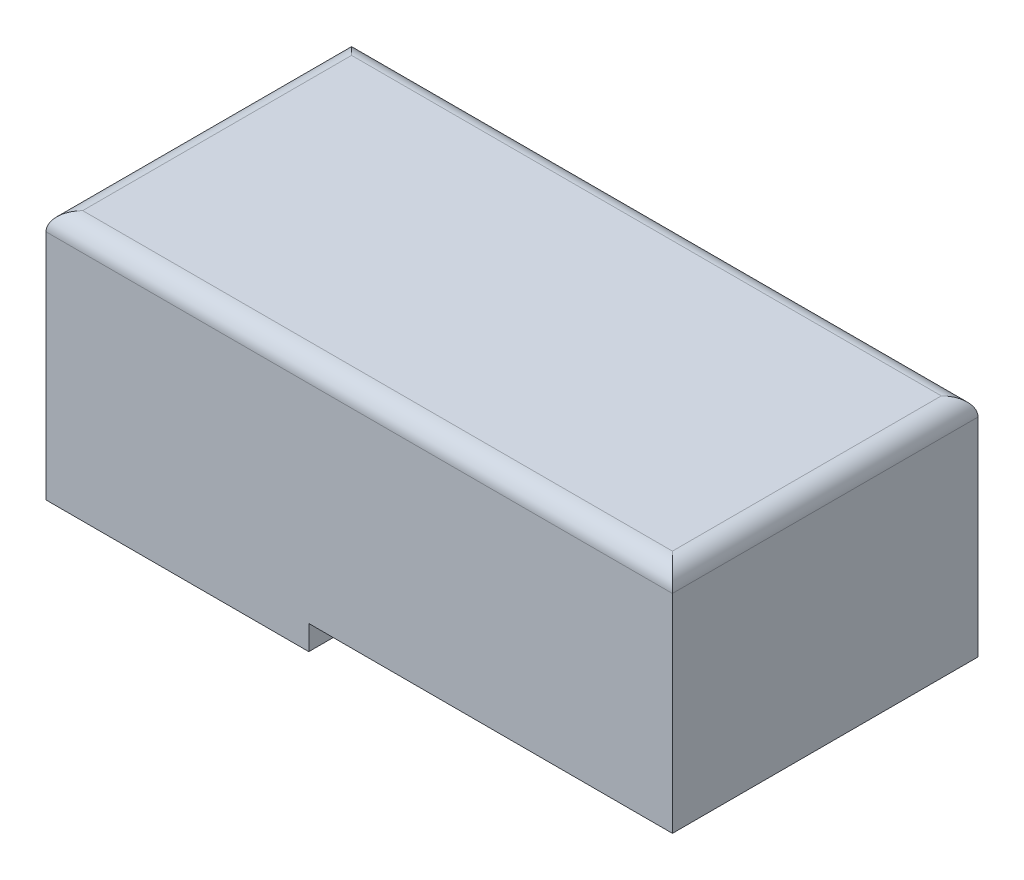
ISO-10303-21;
HEADER;
FILE_DESCRIPTION(('STEP AP214'),'2;1');
FILE_NAME('part.step','',(''),(''),'','','');
FILE_SCHEMA(('AUTOMOTIVE_DESIGN { 1 0 10303 214 1 1 1 1 }'));
ENDSEC;
DATA;
#1=APPLICATION_CONTEXT('core data for automotive mechanical design processes');
#2=APPLICATION_PROTOCOL_DEFINITION('international standard','automotive_design',2000,#1);
#3=PRODUCT_CONTEXT('',#1,'mechanical');
#4=PRODUCT('Part','Part','',(#3));
#5=PRODUCT_RELATED_PRODUCT_CATEGORY('part','',(#4));
#6=PRODUCT_DEFINITION_FORMATION('','',#4);
#7=PRODUCT_DEFINITION_CONTEXT('part definition',#1,'design');
#8=PRODUCT_DEFINITION('design','',#6,#7);
#9=PRODUCT_DEFINITION_SHAPE('','',#8);
#10=(LENGTH_UNIT() NAMED_UNIT(*) SI_UNIT(.MILLI.,.METRE.));
#11=(NAMED_UNIT(*) PLANE_ANGLE_UNIT() SI_UNIT($,.RADIAN.));
#12=(NAMED_UNIT(*) SI_UNIT($,.STERADIAN.) SOLID_ANGLE_UNIT());
#13=UNCERTAINTY_MEASURE_WITH_UNIT(LENGTH_MEASURE(1.E-05),#10,'distance_accuracy_value','');
#14=(GEOMETRIC_REPRESENTATION_CONTEXT(3) GLOBAL_UNCERTAINTY_ASSIGNED_CONTEXT((#13)) GLOBAL_UNIT_ASSIGNED_CONTEXT((#10,
#11,#12)) REPRESENTATION_CONTEXT('',''));
#15=CARTESIAN_POINT('',(0.,0.,0.));
#16=DIRECTION('',(0.,0.,1.));
#17=DIRECTION('',(1.,0.,0.));
#18=AXIS2_PLACEMENT_3D('',#15,#16,#17);
#19=CARTESIAN_POINT('',(-49.0331698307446,-4.,25.));
#20=DIRECTION('',(0.,1.,0.));
#21=DIRECTION('',(-1.,0.,0.));
#22=AXIS2_PLACEMENT_3D('',#19,#20,#21);
#23=PLANE('',#22);
#24=CARTESIAN_POINT('',(-71.0331698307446,-4.00000000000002,0.));
#25=DIRECTION('',(0.,1.,0.));
#26=DIRECTION('',(0.,0.,1.));
#27=AXIS2_PLACEMENT_3D('',#24,#25,#26);
#28=CIRCLE('',#27,7.5);
#29=CARTESIAN_POINT('',(-71.0331698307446,-4.00000000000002,7.5));
#30=VERTEX_POINT('',#29);
#31=EDGE_CURVE('E164',#30,#30,#28,.T.);
#32=ORIENTED_EDGE('',*,*,#31,.T.);
#33=EDGE_LOOP('',(#32));
#34=FACE_BOUND('',#33,.T.);
#35=DIRECTION('',(1.,0.,0.));
#36=VECTOR('',#35,1.);
#37=CARTESIAN_POINT('',(-49.0331698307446,-4.,-25.));
#38=LINE('',#37,#36);
#39=CARTESIAN_POINT('',(-92.0331698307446,-4.00000000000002,-25.));
#40=VERTEX_POINT('',#39);
#41=CARTESIAN_POINT('',(-49.0331698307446,-4.,-25.));
#42=VERTEX_POINT('',#41);
#43=EDGE_CURVE('E167',#40,#42,#38,.T.);
#44=ORIENTED_EDGE('',*,*,#43,.T.);
#45=DIRECTION('',(0.,0.,-1.));
#46=VECTOR('',#45,1.);
#47=CARTESIAN_POINT('',(-49.0331698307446,-4.,25.));
#48=LINE('',#47,#46);
#49=CARTESIAN_POINT('',(-49.0331698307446,-4.,25.));
#50=VERTEX_POINT('',#49);
#51=EDGE_CURVE('E193',#50,#42,#48,.T.);
#52=ORIENTED_EDGE('',*,*,#51,.F.);
#53=DIRECTION('',(1.,0.,0.));
#54=VECTOR('',#53,1.);
#55=CARTESIAN_POINT('',(-49.0331698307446,-4.,25.));
#56=LINE('',#55,#54);
#57=CARTESIAN_POINT('',(-92.0331698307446,-4.00000000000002,25.));
#58=VERTEX_POINT('',#57);
#59=EDGE_CURVE('E168',#58,#50,#56,.T.);
#60=ORIENTED_EDGE('',*,*,#59,.F.);
#61=DIRECTION('',(0.,0.,-1.));
#62=VECTOR('',#61,1.);
#63=CARTESIAN_POINT('',(-92.0331698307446,-4.00000000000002,25.));
#64=LINE('',#63,#62);
#65=EDGE_CURVE('E179',#58,#40,#64,.T.);
#66=ORIENTED_EDGE('',*,*,#65,.T.);
#67=EDGE_LOOP('',(#44,#52,#60,#66));
#68=FACE_BOUND('',#67,.T.);
#69=ADVANCED_FACE('F34',(#34,#68),#23,.F.);
#70=CARTESIAN_POINT('',(-49.0331698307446,0.,25.));
#71=DIRECTION('',(-1.,0.,0.));
#72=DIRECTION('',(0.,0.,1.));
#73=AXIS2_PLACEMENT_3D('',#70,#71,#72);
#74=PLANE('',#73);
#75=DIRECTION('',(0.,1.,0.));
#76=VECTOR('',#75,1.);
#77=CARTESIAN_POINT('',(-49.0331698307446,0.,-25.));
#78=LINE('',#77,#76);
#79=CARTESIAN_POINT('',(-49.0331698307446,0.,-25.));
#80=VERTEX_POINT('',#79);
#81=EDGE_CURVE('E182',#42,#80,#78,.T.);
#82=ORIENTED_EDGE('',*,*,#81,.T.);
#83=DIRECTION('',(0.,0.,-1.));
#84=VECTOR('',#83,1.);
#85=CARTESIAN_POINT('',(-49.0331698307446,0.,25.));
#86=LINE('',#85,#84);
#87=CARTESIAN_POINT('',(-49.0331698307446,0.,25.));
#88=VERTEX_POINT('',#87);
#89=EDGE_CURVE('E190',#88,#80,#86,.T.);
#90=ORIENTED_EDGE('',*,*,#89,.F.);
#91=DIRECTION('',(0.,1.,0.));
#92=VECTOR('',#91,1.);
#93=CARTESIAN_POINT('',(-49.0331698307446,0.,25.));
#94=LINE('',#93,#92);
#95=EDGE_CURVE('E171',#50,#88,#94,.T.);
#96=ORIENTED_EDGE('',*,*,#95,.F.);
#97=ORIENTED_EDGE('',*,*,#51,.T.);
#98=EDGE_LOOP('',(#82,#90,#96,#97));
#99=FACE_BOUND('',#98,.T.);
#100=ADVANCED_FACE('F250',(#99),#74,.F.);
#101=CARTESIAN_POINT('',(13.4668301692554,0.,25.));
#102=DIRECTION('',(0.,1.,0.));
#103=DIRECTION('',(-1.,0.,0.));
#104=AXIS2_PLACEMENT_3D('',#101,#102,#103);
#105=PLANE('',#104);
#106=DIRECTION('',(-1.,0.,0.));
#107=VECTOR('',#106,1.);
#108=CARTESIAN_POINT('',(13.4668301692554,0.,-5.));
#109=LINE('',#108,#107);
#110=CARTESIAN_POINT('',(-7.53316983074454,0.,-5.));
#111=VERTEX_POINT('',#110);
#112=CARTESIAN_POINT('',(-17.5331698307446,0.,-5.));
#113=VERTEX_POINT('',#112);
#114=EDGE_CURVE('E159',#111,#113,#109,.T.);
#115=ORIENTED_EDGE('',*,*,#114,.T.);
#116=CARTESIAN_POINT('',(-17.5331698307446,0.,0.));
#117=DIRECTION('',(0.,1.,0.));
#118=DIRECTION('',(-1.,0.,0.));
#119=AXIS2_PLACEMENT_3D('',#116,#117,#118);
#120=CIRCLE('',#119,5.);
#121=CARTESIAN_POINT('',(-17.5331698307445,0.,5.));
#122=VERTEX_POINT('',#121);
#123=EDGE_CURVE('E162',#113,#122,#120,.T.);
#124=ORIENTED_EDGE('',*,*,#123,.T.);
#125=DIRECTION('',(1.,0.,0.));
#126=VECTOR('',#125,1.);
#127=CARTESIAN_POINT('',(13.4668301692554,0.,5.));
#128=LINE('',#127,#126);
#129=CARTESIAN_POINT('',(-7.53316983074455,0.,5.));
#130=VERTEX_POINT('',#129);
#131=EDGE_CURVE('E146',#122,#130,#128,.T.);
#132=ORIENTED_EDGE('',*,*,#131,.T.);
#133=CARTESIAN_POINT('',(-7.53316983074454,0.,0.));
#134=DIRECTION('',(0.,1.,0.));
#135=DIRECTION('',(-1.,0.,0.));
#136=AXIS2_PLACEMENT_3D('',#133,#134,#135);
#137=CIRCLE('',#136,5.);
#138=EDGE_CURVE('E156',#130,#111,#137,.T.);
#139=ORIENTED_EDGE('',*,*,#138,.T.);
#140=EDGE_LOOP('',(#115,#124,#132,#139));
#141=FACE_BOUND('',#140,.T.);
#142=DIRECTION('',(1.,0.,0.));
#143=VECTOR('',#142,1.);
#144=CARTESIAN_POINT('',(13.4668301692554,0.,-25.));
#145=LINE('',#144,#143);
#146=CARTESIAN_POINT('',(10.4668301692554,0.,-25.));
#147=VERTEX_POINT('',#146);
#148=EDGE_CURVE('E184',#80,#147,#145,.T.);
#149=ORIENTED_EDGE('',*,*,#148,.T.);
#150=DIRECTION('',(0.,0.,1.));
#151=VECTOR('',#150,1.);
#152=CARTESIAN_POINT('',(10.4668301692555,0.,25.));
#153=LINE('',#152,#151);
#154=CARTESIAN_POINT('',(10.4668301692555,0.,25.));
#155=VERTEX_POINT('',#154);
#156=EDGE_CURVE('E142',#147,#155,#153,.T.);
#157=ORIENTED_EDGE('',*,*,#156,.T.);
#158=DIRECTION('',(1.,0.,0.));
#159=VECTOR('',#158,1.);
#160=CARTESIAN_POINT('',(13.4668301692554,0.,25.));
#161=LINE('',#160,#159);
#162=EDGE_CURVE('E174',#88,#155,#161,.T.);
#163=ORIENTED_EDGE('',*,*,#162,.F.);
#164=ORIENTED_EDGE('',*,*,#89,.T.);
#165=EDGE_LOOP('',(#149,#157,#163,#164));
#166=FACE_BOUND('',#165,.T.);
#167=ADVANCED_FACE('F246',(#141,#166),#105,.F.);
#168=CARTESIAN_POINT('',(-92.0331698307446,-4.00000000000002,25.));
#169=DIRECTION('',(1.,0.,0.));
#170=DIRECTION('',(0.,0.,-1.));
#171=AXIS2_PLACEMENT_3D('',#168,#169,#170);
#172=PLANE('',#171);
#173=DIRECTION('',(0.,-1.,0.));
#174=VECTOR('',#173,1.);
#175=CARTESIAN_POINT('',(-92.0331698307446,-4.00000000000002,25.));
#176=LINE('',#175,#174);
#177=CARTESIAN_POINT('',(-92.0331698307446,34.,25.));
#178=VERTEX_POINT('',#177);
#179=EDGE_CURVE('E177',#178,#58,#176,.T.);
#180=ORIENTED_EDGE('',*,*,#179,.F.);
#181=DIRECTION('',(0.,0.,1.));
#182=VECTOR('',#181,1.);
#183=CARTESIAN_POINT('',(-92.0331698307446,34.,25.));
#184=LINE('',#183,#182);
#185=CARTESIAN_POINT('',(-92.0331698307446,34.,-25.));
#186=VERTEX_POINT('',#185);
#187=EDGE_CURVE('E11',#178,#186,#184,.F.);
#188=ORIENTED_EDGE('',*,*,#187,.T.);
#189=DIRECTION('',(0.,-1.,0.));
#190=VECTOR('',#189,1.);
#191=CARTESIAN_POINT('',(-92.0331698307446,-4.00000000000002,-25.));
#192=LINE('',#191,#190);
#193=EDGE_CURVE('E172',#186,#40,#192,.T.);
#194=ORIENTED_EDGE('',*,*,#193,.T.);
#195=ORIENTED_EDGE('',*,*,#65,.F.);
#196=EDGE_LOOP('',(#180,#188,#194,#195));
#197=FACE_BOUND('',#196,.T.);
#198=ADVANCED_FACE('F249',(#197),#172,.F.);
#199=CARTESIAN_POINT('',(0.,0.,25.));
#200=DIRECTION('',(0.,0.,-1.));
#201=DIRECTION('',(-1.,0.,0.));
#202=AXIS2_PLACEMENT_3D('',#199,#200,#201);
#203=PLANE('',#202);
#204=DIRECTION('',(0.,1.,0.));
#205=VECTOR('',#204,1.);
#206=CARTESIAN_POINT('',(10.4668301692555,-4.00000000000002,25.));
#207=LINE('',#206,#205);
#208=CARTESIAN_POINT('',(10.4668301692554,34.,25.));
#209=VERTEX_POINT('',#208);
#210=EDGE_CURVE('E228',#155,#209,#207,.T.);
#211=ORIENTED_EDGE('',*,*,#210,.T.);
#212=DIRECTION('',(1.,0.,0.));
#213=VECTOR('',#212,1.);
#214=CARTESIAN_POINT('',(0.,34.,25.));
#215=LINE('',#214,#213);
#216=EDGE_CURVE('E207',#209,#178,#215,.F.);
#217=ORIENTED_EDGE('',*,*,#216,.T.);
#218=ORIENTED_EDGE('',*,*,#179,.T.);
#219=ORIENTED_EDGE('',*,*,#59,.T.);
#220=ORIENTED_EDGE('',*,*,#95,.T.);
#221=ORIENTED_EDGE('',*,*,#162,.T.);
#222=EDGE_LOOP('',(#211,#217,#218,#219,#220,#221));
#223=FACE_BOUND('',#222,.T.);
#224=ADVANCED_FACE('F269',(#223),#203,.F.);
#225=CARTESIAN_POINT('',(0.,0.,-25.));
#226=DIRECTION('',(0.,0.,-1.));
#227=DIRECTION('',(-1.,0.,0.));
#228=AXIS2_PLACEMENT_3D('',#225,#226,#227);
#229=PLANE('',#228);
#230=ORIENTED_EDGE('',*,*,#193,.F.);
#231=DIRECTION('',(-1.,0.,0.));
#232=VECTOR('',#231,1.);
#233=CARTESIAN_POINT('',(10.4668301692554,34.,-25.));
#234=LINE('',#233,#232);
#235=CARTESIAN_POINT('',(10.4668301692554,34.,-25.));
#236=VERTEX_POINT('',#235);
#237=EDGE_CURVE('E43',#186,#236,#234,.F.);
#238=ORIENTED_EDGE('',*,*,#237,.T.);
#239=DIRECTION('',(0.,1.,0.));
#240=VECTOR('',#239,1.);
#241=CARTESIAN_POINT('',(10.4668301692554,0.,-25.));
#242=LINE('',#241,#240);
#243=EDGE_CURVE('E196',#147,#236,#242,.T.);
#244=ORIENTED_EDGE('',*,*,#243,.F.);
#245=ORIENTED_EDGE('',*,*,#148,.F.);
#246=ORIENTED_EDGE('',*,*,#81,.F.);
#247=ORIENTED_EDGE('',*,*,#43,.F.);
#248=EDGE_LOOP('',(#230,#238,#244,#245,#246,#247));
#249=FACE_BOUND('',#248,.T.);
#250=ADVANCED_FACE('F255',(#249),#229,.T.);
#251=CARTESIAN_POINT('',(-71.0331698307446,-4.00000000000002,0.));
#252=DIRECTION('',(0.,1.,0.));
#253=DIRECTION('',(0.,0.,1.));
#254=AXIS2_PLACEMENT_3D('',#251,#252,#253);
#255=CYLINDRICAL_SURFACE('',#254,7.5);
#256=ORIENTED_EDGE('',*,*,#31,.F.);
#257=EDGE_LOOP('',(#256));
#258=FACE_BOUND('',#257,.T.);
#259=CARTESIAN_POINT('',(-71.0331698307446,8.,0.));
#260=DIRECTION('',(0.,-1.,0.));
#261=DIRECTION('',(1.,0.,0.));
#262=AXIS2_PLACEMENT_3D('',#259,#260,#261);
#263=CIRCLE('',#262,7.5);
#264=CARTESIAN_POINT('',(-63.5331698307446,8.,0.));
#265=VERTEX_POINT('',#264);
#266=EDGE_CURVE('E223',#265,#265,#263,.F.);
#267=ORIENTED_EDGE('',*,*,#266,.T.);
#268=EDGE_LOOP('',(#267));
#269=FACE_BOUND('',#268,.T.);
#270=ADVANCED_FACE('F314',(#258,#269),#255,.F.);
#271=CARTESIAN_POINT('',(-17.5331698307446,-4.00000000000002,0.));
#272=DIRECTION('',(0.,1.,0.));
#273=DIRECTION('',(0.,0.,1.));
#274=AXIS2_PLACEMENT_3D('',#271,#272,#273);
#275=CYLINDRICAL_SURFACE('',#274,5.);
#276=DIRECTION('',(0.,1.,0.));
#277=VECTOR('',#276,1.);
#278=CARTESIAN_POINT('',(-17.5331698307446,-4.00000000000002,-5.));
#279=LINE('',#278,#277);
#280=CARTESIAN_POINT('',(-17.5331698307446,8.00000000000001,-5.));
#281=VERTEX_POINT('',#280);
#282=EDGE_CURVE('E140',#113,#281,#279,.T.);
#283=ORIENTED_EDGE('',*,*,#282,.T.);
#284=CARTESIAN_POINT('',(-17.5331698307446,8.00000000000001,0.));
#285=DIRECTION('',(0.,1.,0.));
#286=DIRECTION('',(0.,0.,1.));
#287=AXIS2_PLACEMENT_3D('',#284,#285,#286);
#288=CIRCLE('',#287,5.);
#289=CARTESIAN_POINT('',(-17.5331698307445,8.00000000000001,5.));
#290=VERTEX_POINT('',#289);
#291=EDGE_CURVE('E126',#281,#290,#288,.T.);
#292=ORIENTED_EDGE('',*,*,#291,.T.);
#293=DIRECTION('',(0.,1.,0.));
#294=VECTOR('',#293,1.);
#295=CARTESIAN_POINT('',(-17.5331698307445,-4.00000000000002,5.));
#296=LINE('',#295,#294);
#297=EDGE_CURVE('E137',#122,#290,#296,.T.);
#298=ORIENTED_EDGE('',*,*,#297,.F.);
#299=ORIENTED_EDGE('',*,*,#123,.F.);
#300=EDGE_LOOP('',(#283,#292,#298,#299));
#301=FACE_BOUND('',#300,.T.);
#302=ADVANCED_FACE('F136',(#301),#275,.F.);
#303=CARTESIAN_POINT('',(-17.5331698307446,-4.00000000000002,-5.));
#304=DIRECTION('',(0.,0.,-1.));
#305=DIRECTION('',(-1.,0.,0.));
#306=AXIS2_PLACEMENT_3D('',#303,#304,#305);
#307=PLANE('',#306);
#308=DIRECTION('',(0.,1.,0.));
#309=VECTOR('',#308,1.);
#310=CARTESIAN_POINT('',(-7.53316983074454,-4.00000000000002,-5.));
#311=LINE('',#310,#309);
#312=CARTESIAN_POINT('',(-7.53316983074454,8.00000000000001,-5.));
#313=VERTEX_POINT('',#312);
#314=EDGE_CURVE('E150',#111,#313,#311,.T.);
#315=ORIENTED_EDGE('',*,*,#314,.T.);
#316=DIRECTION('',(-1.,0.,0.));
#317=VECTOR('',#316,1.);
#318=CARTESIAN_POINT('',(-17.5331698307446,8.00000000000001,-5.));
#319=LINE('',#318,#317);
#320=EDGE_CURVE('E148',#313,#281,#319,.T.);
#321=ORIENTED_EDGE('',*,*,#320,.T.);
#322=ORIENTED_EDGE('',*,*,#282,.F.);
#323=ORIENTED_EDGE('',*,*,#114,.F.);
#324=EDGE_LOOP('',(#315,#321,#322,#323));
#325=FACE_BOUND('',#324,.T.);
#326=ADVANCED_FACE('F241',(#325),#307,.F.);
#327=CARTESIAN_POINT('',(-7.53316983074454,-4.00000000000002,0.));
#328=DIRECTION('',(0.,1.,0.));
#329=DIRECTION('',(0.,0.,1.));
#330=AXIS2_PLACEMENT_3D('',#327,#328,#329);
#331=CYLINDRICAL_SURFACE('',#330,5.);
#332=DIRECTION('',(0.,1.,0.));
#333=VECTOR('',#332,1.);
#334=CARTESIAN_POINT('',(-7.53316983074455,-4.00000000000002,5.));
#335=LINE('',#334,#333);
#336=CARTESIAN_POINT('',(-7.53316983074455,8.00000000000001,5.));
#337=VERTEX_POINT('',#336);
#338=EDGE_CURVE('E147',#130,#337,#335,.T.);
#339=ORIENTED_EDGE('',*,*,#338,.T.);
#340=CARTESIAN_POINT('',(-7.53316983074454,8.00000000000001,0.));
#341=DIRECTION('',(0.,1.,0.));
#342=DIRECTION('',(0.,0.,1.));
#343=AXIS2_PLACEMENT_3D('',#340,#341,#342);
#344=CIRCLE('',#343,5.);
#345=EDGE_CURVE('E129',#337,#313,#344,.T.);
#346=ORIENTED_EDGE('',*,*,#345,.T.);
#347=ORIENTED_EDGE('',*,*,#314,.F.);
#348=ORIENTED_EDGE('',*,*,#138,.F.);
#349=EDGE_LOOP('',(#339,#346,#347,#348));
#350=FACE_BOUND('',#349,.T.);
#351=ADVANCED_FACE('F244',(#350),#331,.F.);
#352=CARTESIAN_POINT('',(-17.5331698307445,-4.00000000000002,5.));
#353=DIRECTION('',(0.,0.,1.));
#354=DIRECTION('',(1.,0.,0.));
#355=AXIS2_PLACEMENT_3D('',#352,#353,#354);
#356=PLANE('',#355);
#357=ORIENTED_EDGE('',*,*,#297,.T.);
#358=DIRECTION('',(1.,0.,0.));
#359=VECTOR('',#358,1.);
#360=CARTESIAN_POINT('',(-17.5331698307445,8.00000000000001,5.));
#361=LINE('',#360,#359);
#362=EDGE_CURVE('E123',#290,#337,#361,.T.);
#363=ORIENTED_EDGE('',*,*,#362,.T.);
#364=ORIENTED_EDGE('',*,*,#338,.F.);
#365=ORIENTED_EDGE('',*,*,#131,.F.);
#366=EDGE_LOOP('',(#357,#363,#364,#365));
#367=FACE_BOUND('',#366,.T.);
#368=ADVANCED_FACE('F144',(#367),#356,.F.);
#369=CARTESIAN_POINT('',(10.4668301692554,-4.00000000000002,-25.));
#370=DIRECTION('',(-1.,0.,0.));
#371=DIRECTION('',(0.,-1.,0.));
#372=AXIS2_PLACEMENT_3D('',#369,#370,#371);
#373=PLANE('',#372);
#374=ORIENTED_EDGE('',*,*,#243,.T.);
#375=DIRECTION('',(0.,0.,-1.));
#376=VECTOR('',#375,1.);
#377=CARTESIAN_POINT('',(10.4668301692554,34.,-25.));
#378=LINE('',#377,#376);
#379=EDGE_CURVE('E210',#236,#209,#378,.F.);
#380=ORIENTED_EDGE('',*,*,#379,.T.);
#381=ORIENTED_EDGE('',*,*,#210,.F.);
#382=ORIENTED_EDGE('',*,*,#156,.F.);
#383=EDGE_LOOP('',(#374,#380,#381,#382));
#384=FACE_BOUND('',#383,.T.);
#385=ADVANCED_FACE('F258',(#384),#373,.F.);
#386=CARTESIAN_POINT('',(0.,37.,0.));
#387=DIRECTION('',(0.,-1.,0.));
#388=DIRECTION('',(1.,0.,0.));
#389=AXIS2_PLACEMENT_3D('',#386,#387,#388);
#390=PLANE('',#389);
#391=DIRECTION('',(0.,0.,1.));
#392=VECTOR('',#391,1.);
#393=CARTESIAN_POINT('',(-89.0331698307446,37.,0.));
#394=LINE('',#393,#392);
#395=CARTESIAN_POINT('',(-89.0331698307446,37.,-22.));
#396=VERTEX_POINT('',#395);
#397=CARTESIAN_POINT('',(-89.0331698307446,37.,22.));
#398=VERTEX_POINT('',#397);
#399=EDGE_CURVE('E198',#396,#398,#394,.T.);
#400=ORIENTED_EDGE('',*,*,#399,.T.);
#401=DIRECTION('',(1.,0.,0.));
#402=VECTOR('',#401,1.);
#403=CARTESIAN_POINT('',(0.,37.,22.));
#404=LINE('',#403,#402);
#405=CARTESIAN_POINT('',(7.46683016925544,37.,22.));
#406=VERTEX_POINT('',#405);
#407=EDGE_CURVE('E204',#398,#406,#404,.T.);
#408=ORIENTED_EDGE('',*,*,#407,.T.);
#409=DIRECTION('',(0.,0.,-1.));
#410=VECTOR('',#409,1.);
#411=CARTESIAN_POINT('',(7.46683016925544,37.,0.));
#412=LINE('',#411,#410);
#413=CARTESIAN_POINT('',(7.46683016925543,37.,-22.));
#414=VERTEX_POINT('',#413);
#415=EDGE_CURVE('E202',#406,#414,#412,.T.);
#416=ORIENTED_EDGE('',*,*,#415,.T.);
#417=DIRECTION('',(-1.,0.,0.));
#418=VECTOR('',#417,1.);
#419=CARTESIAN_POINT('',(-92.0331698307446,37.,-22.));
#420=LINE('',#419,#418);
#421=EDGE_CURVE('E200',#414,#396,#420,.T.);
#422=ORIENTED_EDGE('',*,*,#421,.T.);
#423=EDGE_LOOP('',(#400,#408,#416,#422));
#424=FACE_BOUND('',#423,.T.);
#425=ADVANCED_FACE('F301',(#424),#390,.F.);
#426=CARTESIAN_POINT('',(0.,8.00000000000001,0.));
#427=DIRECTION('',(0.,-1.,0.));
#428=DIRECTION('',(1.,0.,0.));
#429=AXIS2_PLACEMENT_3D('',#426,#427,#428);
#430=PLANE('',#429);
#431=ORIENTED_EDGE('',*,*,#291,.F.);
#432=ORIENTED_EDGE('',*,*,#320,.F.);
#433=ORIENTED_EDGE('',*,*,#345,.F.);
#434=ORIENTED_EDGE('',*,*,#362,.F.);
#435=EDGE_LOOP('',(#431,#432,#433,#434));
#436=FACE_BOUND('',#435,.T.);
#437=ADVANCED_FACE('F125',(#436),#430,.T.);
#438=ORIENTED_EDGE('',*,*,#266,.F.);
#439=EDGE_LOOP('',(#438));
#440=FACE_BOUND('',#439,.T.);
#441=ADVANCED_FACE('F292',(#440),#430,.T.);
#442=CARTESIAN_POINT('',(0.,34.,-22.));
#443=DIRECTION('',(1.,0.,0.));
#444=DIRECTION('',(0.,1.,0.));
#445=AXIS2_PLACEMENT_3D('',#442,#443,#444);
#446=CYLINDRICAL_SURFACE('',#445,3.);
#447=CARTESIAN_POINT('',(7.46683016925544,34.,-22.));
#448=DIRECTION('',(0.707106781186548,0.,0.707106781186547));
#449=DIRECTION('',(0.707106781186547,0.,-0.707106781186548));
#450=AXIS2_PLACEMENT_3D('',#447,#448,#449);
#451=ELLIPSE('',#450,4.24264068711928,3.);
#452=EDGE_CURVE('E216',#236,#414,#451,.T.);
#453=ORIENTED_EDGE('',*,*,#452,.F.);
#454=ORIENTED_EDGE('',*,*,#237,.F.);
#455=CARTESIAN_POINT('',(-89.0331698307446,34.,-22.));
#456=DIRECTION('',(-0.707106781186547,0.,0.707106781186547));
#457=DIRECTION('',(0.707106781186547,0.,0.707106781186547));
#458=AXIS2_PLACEMENT_3D('',#455,#456,#457);
#459=ELLIPSE('',#458,4.24264068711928,3.);
#460=EDGE_CURVE('E38',#396,#186,#459,.T.);
#461=ORIENTED_EDGE('',*,*,#460,.F.);
#462=ORIENTED_EDGE('',*,*,#421,.F.);
#463=EDGE_LOOP('',(#453,#454,#461,#462));
#464=FACE_BOUND('',#463,.T.);
#465=ADVANCED_FACE('F36',(#464),#446,.T.);
#466=CARTESIAN_POINT('',(-89.0331698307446,34.,0.));
#467=DIRECTION('',(0.,0.,1.));
#468=DIRECTION('',(1.,0.,0.));
#469=AXIS2_PLACEMENT_3D('',#466,#467,#468);
#470=CYLINDRICAL_SURFACE('',#469,3.);
#471=ORIENTED_EDGE('',*,*,#460,.T.);
#472=ORIENTED_EDGE('',*,*,#187,.F.);
#473=CARTESIAN_POINT('',(-89.0331698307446,34.,22.));
#474=DIRECTION('',(0.707106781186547,0.,0.707106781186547));
#475=DIRECTION('',(-0.707106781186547,0.,0.707106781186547));
#476=AXIS2_PLACEMENT_3D('',#473,#474,#475);
#477=ELLIPSE('',#476,4.24264068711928,3.);
#478=EDGE_CURVE('E215',#398,#178,#477,.T.);
#479=ORIENTED_EDGE('',*,*,#478,.F.);
#480=ORIENTED_EDGE('',*,*,#399,.F.);
#481=EDGE_LOOP('',(#471,#472,#479,#480));
#482=FACE_BOUND('',#481,.T.);
#483=ADVANCED_FACE('F287',(#482),#470,.T.);
#484=CARTESIAN_POINT('',(7.46683016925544,34.,0.));
#485=DIRECTION('',(0.,0.,-1.));
#486=DIRECTION('',(-1.,0.,0.));
#487=AXIS2_PLACEMENT_3D('',#484,#485,#486);
#488=CYLINDRICAL_SURFACE('',#487,3.);
#489=ORIENTED_EDGE('',*,*,#452,.T.);
#490=ORIENTED_EDGE('',*,*,#415,.F.);
#491=CARTESIAN_POINT('',(7.46683016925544,34.,22.));
#492=DIRECTION('',(0.707106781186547,0.,-0.707106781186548));
#493=DIRECTION('',(-0.707106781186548,0.,-0.707106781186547));
#494=AXIS2_PLACEMENT_3D('',#491,#492,#493);
#495=ELLIPSE('',#494,4.24264068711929,3.);
#496=EDGE_CURVE('E213',#209,#406,#495,.F.);
#497=ORIENTED_EDGE('',*,*,#496,.F.);
#498=ORIENTED_EDGE('',*,*,#379,.F.);
#499=EDGE_LOOP('',(#489,#490,#497,#498));
#500=FACE_BOUND('',#499,.T.);
#501=ADVANCED_FACE('F262',(#500),#488,.T.);
#502=CARTESIAN_POINT('',(0.,34.,22.));
#503=DIRECTION('',(1.,0.,0.));
#504=DIRECTION('',(0.,1.,0.));
#505=AXIS2_PLACEMENT_3D('',#502,#503,#504);
#506=CYLINDRICAL_SURFACE('',#505,3.);
#507=ORIENTED_EDGE('',*,*,#478,.T.);
#508=ORIENTED_EDGE('',*,*,#216,.F.);
#509=ORIENTED_EDGE('',*,*,#496,.T.);
#510=ORIENTED_EDGE('',*,*,#407,.F.);
#511=EDGE_LOOP('',(#507,#508,#509,#510));
#512=FACE_BOUND('',#511,.T.);
#513=ADVANCED_FACE('F266',(#512),#506,.T.);
#514=CLOSED_SHELL('',(#69,#100,#167,#198,#224,#250,#270,#302,#326,#351,#368,#385,#425,#437,#441,
#465,#483,#501,#513));
#515=MANIFOLD_SOLID_BREP('B2',#514);
#516=ADVANCED_BREP_SHAPE_REPRESENTATION('',(#18,#515),#14);
#517=SHAPE_DEFINITION_REPRESENTATION(#9,#516);
ENDSEC;
END-ISO-10303-21;
